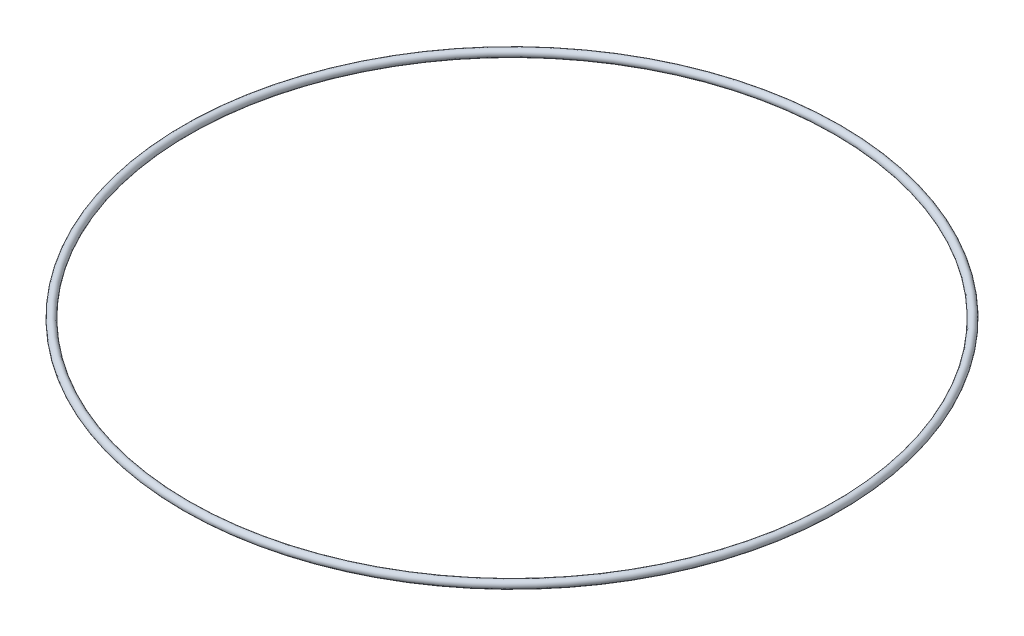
from build123d import *

# Parameters (mm, degrees)
ESQUISSE1_R = 1.5


with BuildPart() as part:
    # Esquisse1 → Base-R_volution (revolve)
    with BuildSketch(Plane.XY, mode=Mode.PRIVATE) as base_r_volution_sk:
        with Locations((127, 0)):
            Circle(ESQUISSE1_R)
    revolve(base_r_volution_sk.sketch.rotate(Axis((0, 1.5, 0), (0, -1, 0)), 90), axis=Axis((0, 1.5, 0), (0, -1, 0)))


solid = part.part
